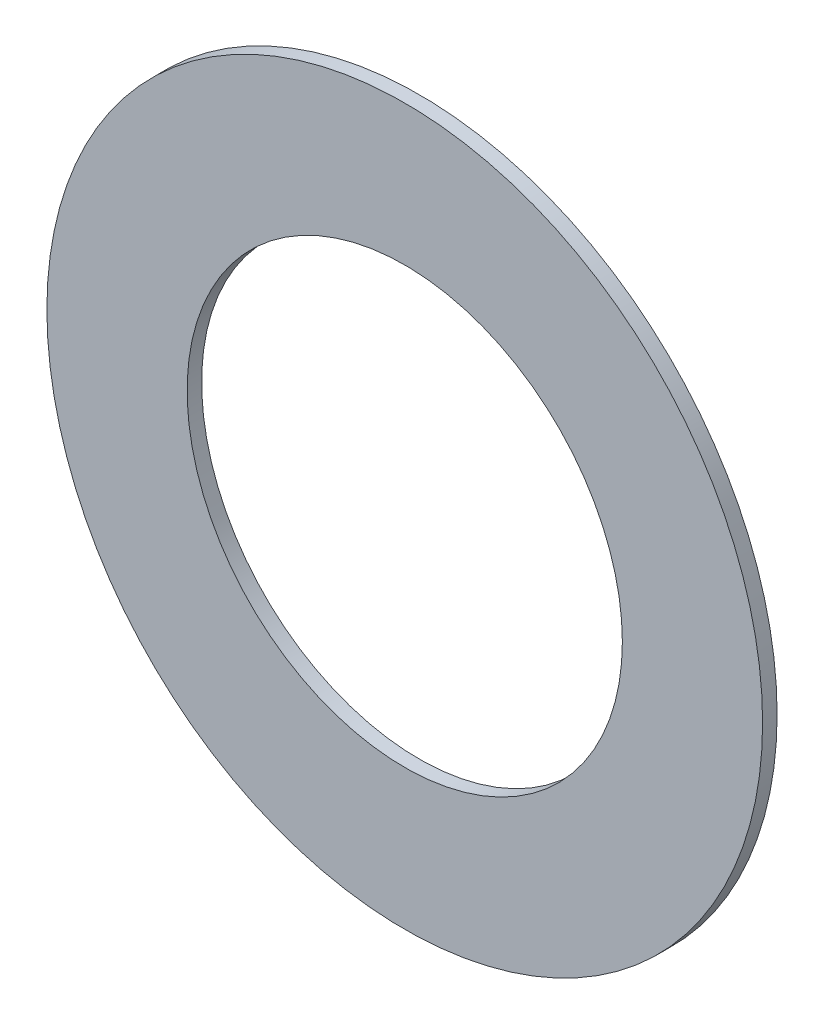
from build123d import *

# Parameters (mm, degrees)
ESQUISSE1_R          = 37
ESQUISSE1_R_2        = 22.5
BASE_EXTRUSION_DEPTH = 1.5


with BuildPart() as part:
    # Esquisse1 → Base-Extrusion (new body)
    with BuildSketch(Plane.XY):
        Circle(ESQUISSE1_R)
        Circle(ESQUISSE1_R_2, mode=Mode.SUBTRACT)
    extrude(amount=BASE_EXTRUSION_DEPTH)


solid = part.part
